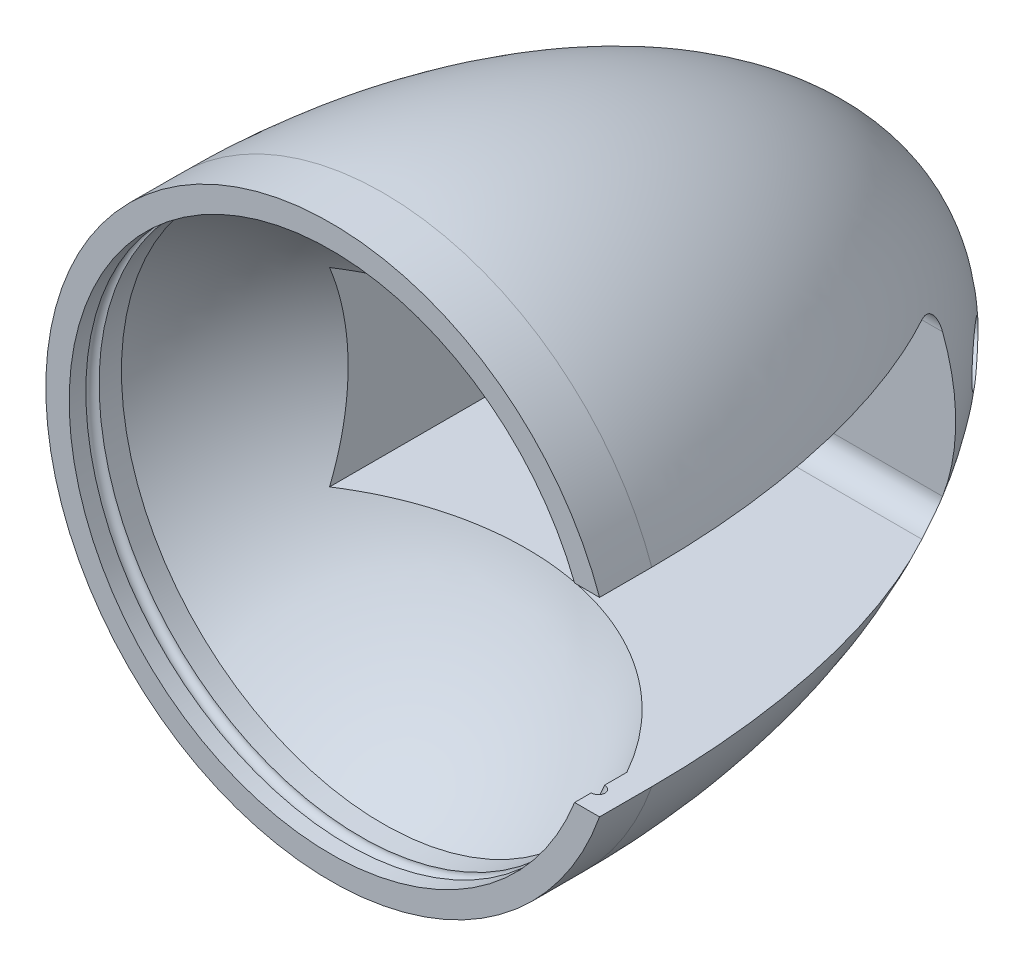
ISO-10303-21;
HEADER;
FILE_DESCRIPTION(('STEP AP214'),'2;1');
FILE_NAME('part.step','',(''),(''),'','','');
FILE_SCHEMA(('AUTOMOTIVE_DESIGN { 1 0 10303 214 1 1 1 1 }'));
ENDSEC;
DATA;
#1=APPLICATION_CONTEXT('core data for automotive mechanical design processes');
#2=APPLICATION_PROTOCOL_DEFINITION('international standard','automotive_design',2000,#1);
#3=PRODUCT_CONTEXT('',#1,'mechanical');
#4=PRODUCT('Part','Part','',(#3));
#5=PRODUCT_RELATED_PRODUCT_CATEGORY('part','',(#4));
#6=PRODUCT_DEFINITION_FORMATION('','',#4);
#7=PRODUCT_DEFINITION_CONTEXT('part definition',#1,'design');
#8=PRODUCT_DEFINITION('design','',#6,#7);
#9=PRODUCT_DEFINITION_SHAPE('','',#8);
#10=(LENGTH_UNIT() NAMED_UNIT(*) SI_UNIT(.MILLI.,.METRE.));
#11=(NAMED_UNIT(*) PLANE_ANGLE_UNIT() SI_UNIT($,.RADIAN.));
#12=(NAMED_UNIT(*) SI_UNIT($,.STERADIAN.) SOLID_ANGLE_UNIT());
#13=UNCERTAINTY_MEASURE_WITH_UNIT(LENGTH_MEASURE(1.E-05),#10,'distance_accuracy_value','');
#14=(GEOMETRIC_REPRESENTATION_CONTEXT(3) GLOBAL_UNCERTAINTY_ASSIGNED_CONTEXT((#13)) GLOBAL_UNIT_ASSIGNED_CONTEXT((#10,
#11,#12)) REPRESENTATION_CONTEXT('',''));
#15=CARTESIAN_POINT('',(0.,0.,0.));
#16=DIRECTION('',(0.,0.,1.));
#17=DIRECTION('',(1.,0.,0.));
#18=AXIS2_PLACEMENT_3D('',#15,#16,#17);
#19=CARTESIAN_POINT('',(0.,0.,27.9835117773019));
#20=DIRECTION('',(0.,0.,1.));
#21=DIRECTION('',(1.,0.,0.));
#22=AXIS2_PLACEMENT_3D('',#19,#20,#21);
#23=CYLINDRICAL_SURFACE('',#22,38.1);
#24=DIRECTION('',(0.,0.,1.));
#25=VECTOR('',#24,1.);
#26=CARTESIAN_POINT('',(35.9210244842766,12.7,27.9835117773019));
#27=LINE('',#26,#25);
#28=CARTESIAN_POINT('',(35.9210244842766,12.7,-6.98500000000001));
#29=VERTEX_POINT('',#28);
#30=CARTESIAN_POINT('',(35.9210244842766,12.7,0.));
#31=VERTEX_POINT('',#30);
#32=EDGE_CURVE('E208',#29,#31,#27,.T.);
#33=ORIENTED_EDGE('',*,*,#32,.F.);
#34=CARTESIAN_POINT('',(0.,0.,-6.985));
#35=DIRECTION('',(0.,0.,1.));
#36=DIRECTION('',(1.,0.,0.));
#37=AXIS2_PLACEMENT_3D('',#34,#35,#36);
#38=CIRCLE('',#37,38.1);
#39=CARTESIAN_POINT('',(35.9210244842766,-12.7,-6.98500000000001));
#40=VERTEX_POINT('',#39);
#41=EDGE_CURVE('E226',#29,#40,#38,.T.);
#42=ORIENTED_EDGE('',*,*,#41,.T.);
#43=DIRECTION('',(0.,0.,1.));
#44=VECTOR('',#43,1.);
#45=CARTESIAN_POINT('',(35.9210244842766,-12.7,27.9835117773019));
#46=LINE('',#45,#44);
#47=CARTESIAN_POINT('',(35.9210244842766,-12.7,0.));
#48=VERTEX_POINT('',#47);
#49=EDGE_CURVE('E192',#48,#40,#46,.F.);
#50=ORIENTED_EDGE('',*,*,#49,.F.);
#51=CARTESIAN_POINT('',(0.,0.,0.));
#52=DIRECTION('',(0.,0.,1.));
#53=DIRECTION('',(1.,0.,0.));
#54=AXIS2_PLACEMENT_3D('',#51,#52,#53);
#55=CIRCLE('',#54,38.1);
#56=EDGE_CURVE('E223',#31,#48,#55,.T.);
#57=ORIENTED_EDGE('',*,*,#56,.F.);
#58=EDGE_LOOP('',(#33,#42,#50,#57));
#59=FACE_BOUND('',#58,.T.);
#60=ADVANCED_FACE('F36',(#59),#23,.T.);
#61=CARTESIAN_POINT('',(0.,0.,0.));
#62=DIRECTION('',(0.,0.,-1.));
#63=DIRECTION('',(-1.,0.,0.));
#64=AXIS2_PLACEMENT_3D('',#61,#62,#63);
#65=PLANE('',#64);
#66=CARTESIAN_POINT('',(0.,0.,0.));
#67=DIRECTION('',(0.,0.,1.));
#68=DIRECTION('',(1.,0.,0.));
#69=AXIS2_PLACEMENT_3D('',#66,#67,#68);
#70=CIRCLE('',#69,34.9758);
#71=CARTESIAN_POINT('',(32.5885959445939,12.7,0.));
#72=VERTEX_POINT('',#71);
#73=CARTESIAN_POINT('',(32.5885959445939,-12.7,0.));
#74=VERTEX_POINT('',#73);
#75=EDGE_CURVE('E220',#72,#74,#70,.T.);
#76=ORIENTED_EDGE('',*,*,#75,.F.);
#77=DIRECTION('',(1.,0.,0.));
#78=VECTOR('',#77,1.);
#79=CARTESIAN_POINT('',(-20.32,12.7,0.));
#80=LINE('',#79,#78);
#81=EDGE_CURVE('E150',#72,#31,#80,.T.);
#82=ORIENTED_EDGE('',*,*,#81,.T.);
#83=ORIENTED_EDGE('',*,*,#56,.T.);
#84=DIRECTION('',(1.,0.,0.));
#85=VECTOR('',#84,1.);
#86=CARTESIAN_POINT('',(-20.32,-12.7,0.));
#87=LINE('',#86,#85);
#88=EDGE_CURVE('E138',#74,#48,#87,.T.);
#89=ORIENTED_EDGE('',*,*,#88,.F.);
#90=EDGE_LOOP('',(#76,#82,#83,#89));
#91=FACE_BOUND('',#90,.T.);
#92=ADVANCED_FACE('F248',(#91),#65,.F.);
#93=CARTESIAN_POINT('',(0.,0.,27.9835117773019));
#94=DIRECTION('',(0.,0.,1.));
#95=DIRECTION('',(1.,0.,0.));
#96=AXIS2_PLACEMENT_3D('',#93,#94,#95);
#97=CYLINDRICAL_SURFACE('',#96,34.9758);
#98=CARTESIAN_POINT('',(0.,0.,-2.2225));
#99=DIRECTION('',(0.,0.,1.));
#100=DIRECTION('',(1.,0.,0.));
#101=AXIS2_PLACEMENT_3D('',#98,#99,#100);
#102=CIRCLE('',#101,34.9758);
#103=CARTESIAN_POINT('',(32.5885959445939,12.7,-2.22249999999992));
#104=VERTEX_POINT('',#103);
#105=CARTESIAN_POINT('',(32.5885959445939,-12.7,-2.2225));
#106=VERTEX_POINT('',#105);
#107=EDGE_CURVE('E217',#104,#106,#102,.T.);
#108=ORIENTED_EDGE('',*,*,#107,.F.);
#109=DIRECTION('',(0.,0.,1.));
#110=VECTOR('',#109,1.);
#111=CARTESIAN_POINT('',(32.5885959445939,12.7,27.9835117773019));
#112=LINE('',#111,#110);
#113=EDGE_CURVE('E310',#104,#72,#112,.T.);
#114=ORIENTED_EDGE('',*,*,#113,.T.);
#115=ORIENTED_EDGE('',*,*,#75,.T.);
#116=DIRECTION('',(0.,0.,1.));
#117=VECTOR('',#116,1.);
#118=CARTESIAN_POINT('',(32.5885959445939,-12.7,27.9835117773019));
#119=LINE('',#118,#117);
#120=EDGE_CURVE('E171',#74,#106,#119,.F.);
#121=ORIENTED_EDGE('',*,*,#120,.T.);
#122=EDGE_LOOP('',(#108,#114,#115,#121));
#123=FACE_BOUND('',#122,.T.);
#124=ADVANCED_FACE('F253',(#123),#97,.F.);
#125=CARTESIAN_POINT('',(0.,0.,-3.1115));
#126=DIRECTION('',(0.,0.,1.));
#127=DIRECTION('',(1.,0.,0.));
#128=AXIS2_PLACEMENT_3D('',#125,#126,#127);
#129=TOROIDAL_SURFACE('',#128,34.9758,0.889000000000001);
#130=CARTESIAN_POINT('',(31.811688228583,12.7,-3.62918445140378));
#131=CARTESIAN_POINT('',(31.7823798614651,12.7,-3.59118233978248));
#132=CARTESIAN_POINT('',(31.7561237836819,12.7,-3.5508000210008));
#133=CARTESIAN_POINT('',(31.7106512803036,12.7,-3.46621901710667));
#134=CARTESIAN_POINT('',(31.691437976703,12.7,-3.42201865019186));
#135=CARTESIAN_POINT('',(31.6607841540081,12.7,-3.33090519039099));
#136=CARTESIAN_POINT('',(31.6493566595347,12.7,-3.28398769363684));
#137=CARTESIAN_POINT('',(31.6348119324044,12.7,-3.18888597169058));
#138=CARTESIAN_POINT('',(31.6316928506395,12.7,-3.14070203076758));
#139=CARTESIAN_POINT('',(31.6338620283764,12.7,-3.04591216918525));
#140=CARTESIAN_POINT('',(31.6389118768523,12.7,-2.99930060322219));
#141=CARTESIAN_POINT('',(31.6567645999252,12.7,-2.90759241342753));
#142=CARTESIAN_POINT('',(31.6695673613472,12.7,-2.86249576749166));
#143=CARTESIAN_POINT('',(31.7024420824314,12.7,-2.77499156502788));
#144=CARTESIAN_POINT('',(31.7225216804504,12.7,-2.73258688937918));
#145=CARTESIAN_POINT('',(31.7692210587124,12.7,-2.6515545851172));
#146=CARTESIAN_POINT('',(31.7958418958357,12.7,-2.61292756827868));
#147=CARTESIAN_POINT('',(31.8560797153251,12.7,-2.53865686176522));
#148=CARTESIAN_POINT('',(31.889956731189,12.7,-2.50322440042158));
#149=CARTESIAN_POINT('',(31.962839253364,12.7,-2.43810738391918));
#150=CARTESIAN_POINT('',(32.0018462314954,12.7,-2.40842448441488));
#151=CARTESIAN_POINT('',(32.0867083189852,12.7,-2.35350837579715));
#152=CARTESIAN_POINT('',(32.1328490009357,12.7,-2.32871648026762));
#153=CARTESIAN_POINT('',(32.2284529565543,12.7,-2.28669547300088));
#154=CARTESIAN_POINT('',(32.2779172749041,12.7,-2.26946875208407));
#155=CARTESIAN_POINT('',(32.3821406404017,12.7,-2.24199094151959));
#156=CARTESIAN_POINT('',(32.4370360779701,12.7,-2.23225566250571));
#157=CARTESIAN_POINT('',(32.5476841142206,12.7,-2.22180806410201));
#158=CARTESIAN_POINT('',(32.6034369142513,12.7,-2.22109789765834));
#159=CARTESIAN_POINT('',(32.7161752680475,12.7,-2.22886159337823));
#160=CARTESIAN_POINT('',(32.7731401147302,12.7,-2.23764182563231));
#161=CARTESIAN_POINT('',(32.8847610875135,12.7,-2.26475473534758));
#162=CARTESIAN_POINT('',(32.9394171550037,12.7,-2.28308765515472));
#163=CARTESIAN_POINT('',(33.0440657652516,12.7,-2.32870692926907));
#164=CARTESIAN_POINT('',(33.0941076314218,12.7,-2.3558797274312));
#165=CARTESIAN_POINT('',(33.1885784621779,12.7,-2.41868655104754));
#166=CARTESIAN_POINT('',(33.2330090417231,12.7,-2.45431813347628));
#167=CARTESIAN_POINT('',(33.3123961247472,12.7,-2.53106971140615));
#168=CARTESIAN_POINT('',(33.3477297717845,12.7,-2.57179907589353));
#169=CARTESIAN_POINT('',(33.4104530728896,12.7,-2.65897777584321));
#170=CARTESIAN_POINT('',(33.4378464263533,12.7,-2.70542443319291));
#171=CARTESIAN_POINT('',(33.4819426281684,12.7,-2.7992885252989));
#172=CARTESIAN_POINT('',(33.4992474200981,12.7,-2.84642344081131));
#173=CARTESIAN_POINT('',(33.5252159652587,12.7,-2.94301451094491));
#174=CARTESIAN_POINT('',(33.5338828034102,12.7,-2.99246983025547));
#175=CARTESIAN_POINT('',(33.5419925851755,12.7,-3.08958066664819));
#176=CARTESIAN_POINT('',(33.5418835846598,12.7,-3.13719927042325));
#177=CARTESIAN_POINT('',(33.5335599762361,12.7,-3.23171782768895));
#178=CARTESIAN_POINT('',(33.5253463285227,12.7,-3.27861786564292));
#179=CARTESIAN_POINT('',(33.5012887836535,12.7,-3.36978633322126));
#180=CARTESIAN_POINT('',(33.4855406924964,12.7,-3.41408016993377));
#181=CARTESIAN_POINT('',(33.4470324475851,12.7,-3.49949994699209));
#182=CARTESIAN_POINT('',(33.4242716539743,12.7,-3.54062559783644));
#183=CARTESIAN_POINT('',(33.3717660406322,12.7,-3.6198459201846));
#184=CARTESIAN_POINT('',(33.3418402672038,12.7,-3.65782042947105));
#185=CARTESIAN_POINT('',(33.2763538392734,12.7,-3.72854402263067));
#186=CARTESIAN_POINT('',(33.2407918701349,12.7,-3.76129188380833));
#187=CARTESIAN_POINT('',(33.1629038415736,12.7,-3.8226375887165));
#188=CARTESIAN_POINT('',(33.1203077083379,12.7,-3.85089230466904));
#189=CARTESIAN_POINT('',(33.0312071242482,12.7,-3.90035442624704));
#190=CARTESIAN_POINT('',(32.9847015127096,12.7,-3.92155972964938));
#191=CARTESIAN_POINT('',(32.8858971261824,12.7,-3.95772957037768));
#192=CARTESIAN_POINT('',(32.8334181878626,12.7,-3.97220247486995));
#193=CARTESIAN_POINT('',(32.7268224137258,12.7,-3.99257965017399));
#194=CARTESIAN_POINT('',(32.6727051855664,12.7,-3.99848185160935));
#195=CARTESIAN_POINT('',(32.5616302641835,12.7,-4.00172228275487));
#196=CARTESIAN_POINT('',(32.5046598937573,12.7,-3.99863984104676));
#197=CARTESIAN_POINT('',(32.3919981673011,12.7,-3.98305285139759));
#198=CARTESIAN_POINT('',(32.3363073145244,12.7,-3.97054465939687));
#199=CARTESIAN_POINT('',(32.2273035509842,12.7,-3.93615652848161));
#200=CARTESIAN_POINT('',(32.1740184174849,12.7,-3.91418825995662));
#201=CARTESIAN_POINT('',(32.0721412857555,12.7,-3.86128903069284));
#202=CARTESIAN_POINT('',(32.0235431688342,12.7,-3.83036997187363));
#203=CARTESIAN_POINT('',(31.9470362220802,12.7,-3.77130915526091));
#204=CARTESIAN_POINT('',(31.9174239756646,12.7,-3.74534625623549));
#205=CARTESIAN_POINT('',(31.8617548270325,12.7,-3.68984911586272));
#206=CARTESIAN_POINT('',(31.8356973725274,12.7,-3.66031543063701));
#207=CARTESIAN_POINT('',(31.811688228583,12.7,-3.62918445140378));
#208=B_SPLINE_CURVE_WITH_KNOTS('',3,(#130,#131,#132,#133,#134,#135,#136,#137,#138,#139,#140,
#141,#142,#143,#144,#145,#146,#147,#148,#149,#150,#151,#152,#153,#154,#155,#156,#157,#158,#159,
#160,#161,#162,#163,#164,#165,#166,#167,#168,#169,#170,#171,#172,#173,#174,#175,#176,#177,#178,
#179,#180,#181,#182,#183,#184,#185,#186,#187,#188,#189,#190,#191,#192,#193,#194,#195,#196,#197,
#198,#199,#200,#201,#202,#203,#204,#205,#206,#207),.UNSPECIFIED.,.T.,.F.,(4,2,2,2,2,2,2,2,2,2,2,
2,2,2,2,2,2,2,2,2,2,2,2,2,2,2,2,2,2,2,2,2,2,2,2,2,2,2,4),(0.,0.143841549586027,
0.287746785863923,0.431892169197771,0.576005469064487,0.71598815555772,0.855968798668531,
0.996096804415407,1.13624746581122,1.28267794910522,1.42915053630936,1.58560880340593,
1.74211648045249,1.90862035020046,2.07516393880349,2.24724899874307,2.41933842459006,
2.58929916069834,2.75921086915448,2.9201235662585,3.08096117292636,3.23082354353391,
3.38063237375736,3.52279772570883,3.66494623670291,3.80533341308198,3.94573340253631,
4.09014458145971,4.23458949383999,4.38727104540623,4.53999808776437,4.70259106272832,
4.86522328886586,5.03559063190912,5.20602387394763,5.37808419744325,5.54991677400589,
5.66776877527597,5.78560244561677),.UNSPECIFIED.);
#209=CARTESIAN_POINT('',(32.5885959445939,12.7,-4.0005));
#210=VERTEX_POINT('',#209);
#211=EDGE_CURVE('E303',#104,#210,#208,.T.);
#212=ORIENTED_EDGE('',*,*,#211,.F.);
#213=ORIENTED_EDGE('',*,*,#107,.T.);
#214=CARTESIAN_POINT('',(31.811688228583,-12.7,-3.62918445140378));
#215=CARTESIAN_POINT('',(31.8440242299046,-12.7,-3.67110533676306));
#216=CARTESIAN_POINT('',(31.8801273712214,-12.7,-3.71019179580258));
#217=CARTESIAN_POINT('',(31.9585030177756,-12.7,-3.78168962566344));
#218=CARTESIAN_POINT('',(32.0007886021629,-12.7,-3.81408648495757));
#219=CARTESIAN_POINT('',(32.0899541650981,-12.7,-3.87138588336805));
#220=CARTESIAN_POINT('',(32.1368181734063,-12.7,-3.89631332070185));
#221=CARTESIAN_POINT('',(32.2338852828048,-12.7,-3.9383777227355));
#222=CARTESIAN_POINT('',(32.2840872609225,-12.7,-3.95551729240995));
#223=CARTESIAN_POINT('',(32.3891835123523,-12.7,-3.98243488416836));
#224=CARTESIAN_POINT('',(32.4441863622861,-12.7,-3.99178971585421));
#225=CARTESIAN_POINT('',(32.5549919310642,-12.7,-4.00145975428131));
#226=CARTESIAN_POINT('',(32.6107949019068,-12.7,-4.00177204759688));
#227=CARTESIAN_POINT('',(32.7235342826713,-12.7,-3.99318830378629));
#228=CARTESIAN_POINT('',(32.7804481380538,-12.7,-3.98399100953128));
#229=CARTESIAN_POINT('',(32.8918932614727,-12.7,-3.95604847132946));
#230=CARTESIAN_POINT('',(32.9464244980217,-12.7,-3.93730310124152));
#231=CARTESIAN_POINT('',(33.050694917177,-12.7,-3.89090219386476));
#232=CARTESIAN_POINT('',(33.100488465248,-12.7,-3.86336925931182));
#233=CARTESIAN_POINT('',(33.1943975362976,-12.7,-3.79988616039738));
#234=CARTESIAN_POINT('',(33.2385147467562,-12.7,-3.76393850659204));
#235=CARTESIAN_POINT('',(33.3172071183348,-12.7,-3.68665375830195));
#236=CARTESIAN_POINT('',(33.352167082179,-12.7,-3.64570899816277));
#237=CARTESIAN_POINT('',(33.414110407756,-12.7,-3.55817076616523));
#238=CARTESIAN_POINT('',(33.4410974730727,-12.7,-3.51157993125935));
#239=CARTESIAN_POINT('',(33.4843937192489,-12.7,-3.41751233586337));
#240=CARTESIAN_POINT('',(33.5013056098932,-12.7,-3.37031270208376));
#241=CARTESIAN_POINT('',(33.5264896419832,-12.7,-3.27366417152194));
#242=CARTESIAN_POINT('',(33.5347648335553,-12.7,-3.22421607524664));
#243=CARTESIAN_POINT('',(33.5421321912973,-12.7,-3.12715388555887));
#244=CARTESIAN_POINT('',(33.5416657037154,-12.7,-3.07957279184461));
#245=CARTESIAN_POINT('',(33.5326467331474,-12.7,-2.98518816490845));
#246=CARTESIAN_POINT('',(33.5240951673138,-12.7,-2.93838454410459));
#247=CARTESIAN_POINT('',(33.4993860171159,-12.7,-2.84741649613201));
#248=CARTESIAN_POINT('',(33.4833167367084,-12.7,-2.80322796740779));
#249=CARTESIAN_POINT('',(33.4441931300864,-12.7,-2.71806664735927));
#250=CARTESIAN_POINT('',(33.4211381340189,-12.7,-2.67709416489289));
#251=CARTESIAN_POINT('',(33.3680497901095,-12.7,-2.5981942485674));
#252=CARTESIAN_POINT('',(33.3378314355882,-12.7,-2.56039153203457));
#253=CARTESIAN_POINT('',(33.2717929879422,-12.7,-2.49005332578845));
#254=CARTESIAN_POINT('',(33.2359715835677,-12.7,-2.45751907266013));
#255=CARTESIAN_POINT('',(33.1575729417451,-12.7,-2.39663629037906));
#256=CARTESIAN_POINT('',(33.1147258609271,-12.7,-2.3686354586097));
#257=CARTESIAN_POINT('',(33.0251661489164,-12.7,-2.31971804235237));
#258=CARTESIAN_POINT('',(32.9784523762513,-12.7,-2.29880355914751));
#259=CARTESIAN_POINT('',(32.8792717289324,-12.7,-2.26326824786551));
#260=CARTESIAN_POINT('',(32.8266281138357,-12.7,-2.24914016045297));
#261=CARTESIAN_POINT('',(32.7197575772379,-12.7,-2.22947933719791));
#262=CARTESIAN_POINT('',(32.6655302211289,-12.7,-2.22394898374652));
#263=CARTESIAN_POINT('',(32.5543202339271,-12.7,-2.22149380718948));
#264=CARTESIAN_POINT('',(32.4973279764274,-12.7,-2.22498598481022));
#265=CARTESIAN_POINT('',(32.3847076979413,-12.7,-2.24139842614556));
#266=CARTESIAN_POINT('',(32.3290798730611,-12.7,-2.25432003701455));
#267=CARTESIAN_POINT('',(32.2203536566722,-12.7,-2.28951345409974));
#268=CARTESIAN_POINT('',(32.1672793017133,-12.7,-2.31185987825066));
#269=CARTESIAN_POINT('',(32.0658428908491,-12.7,-2.36549344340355));
#270=CARTESIAN_POINT('',(32.0174801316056,-12.7,-2.39677924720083));
#271=CARTESIAN_POINT('',(31.9289704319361,-12.7,-2.46621949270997));
#272=CARTESIAN_POINT('',(31.8885767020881,-12.7,-2.50405861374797));
#273=CARTESIAN_POINT('',(31.8153096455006,-12.7,-2.58643475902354));
#274=CARTESIAN_POINT('',(31.7824327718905,-12.7,-2.63096860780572));
#275=CARTESIAN_POINT('',(31.7276455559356,-12.7,-2.72209753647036));
#276=CARTESIAN_POINT('',(31.7051254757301,-12.7,-2.76832595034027));
#277=CARTESIAN_POINT('',(31.66880053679,-12.7,-2.86408521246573));
#278=CARTESIAN_POINT('',(31.6549911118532,-12.7,-2.91361431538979));
#279=CARTESIAN_POINT('',(31.6373282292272,-12.7,-3.01101936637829));
#280=CARTESIAN_POINT('',(31.6328756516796,-12.7,-3.0587873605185));
#281=CARTESIAN_POINT('',(31.6323078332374,-12.7,-3.15438349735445));
#282=CARTESIAN_POINT('',(31.6361932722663,-12.7,-3.20221164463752));
#283=CARTESIAN_POINT('',(31.6519126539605,-12.7,-3.29517822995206));
#284=CARTESIAN_POINT('',(31.6635259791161,-12.7,-3.34035445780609));
#285=CARTESIAN_POINT('',(31.6940163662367,-12.7,-3.42813324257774));
#286=CARTESIAN_POINT('',(31.7128840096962,-12.7,-3.47073905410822));
#287=CARTESIAN_POINT('',(31.7461948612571,-12.7,-3.53212497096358));
#288=CARTESIAN_POINT('',(31.7582074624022,-12.7,-3.55226232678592));
#289=CARTESIAN_POINT('',(31.7837968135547,-12.7,-3.59151302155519));
#290=CARTESIAN_POINT('',(31.7973733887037,-12.7,-3.61062647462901));
#291=CARTESIAN_POINT('',(31.811688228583,-12.7,-3.62918445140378));
#292=B_SPLINE_CURVE_WITH_KNOTS('',3,(#214,#215,#216,#217,#218,#219,#220,#221,#222,#223,#224,
#225,#226,#227,#228,#229,#230,#231,#232,#233,#234,#235,#236,#237,#238,#239,#240,#241,#242,#243,
#244,#245,#246,#247,#248,#249,#250,#251,#252,#253,#254,#255,#256,#257,#258,#259,#260,#261,#262,
#263,#264,#265,#266,#267,#268,#269,#270,#271,#272,#273,#274,#275,#276,#277,#278,#279,#280,#281,
#282,#283,#284,#285,#286,#287,#288,#289,#290,#291),.UNSPECIFIED.,.T.,.F.,(4,2,2,2,2,2,2,2,2,2,2,
2,2,2,2,2,2,2,2,2,2,2,2,2,2,2,2,2,2,2,2,2,2,2,2,2,2,2,4),(0.,0.158737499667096,
0.317815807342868,0.476357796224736,0.634846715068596,0.801473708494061,0.968154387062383,
1.140282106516,1.31241210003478,1.48223846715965,1.65201423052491,1.81268663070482,
1.97328427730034,2.12292913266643,2.27252112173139,2.41458187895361,2.55662652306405,
2.69704304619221,2.83747303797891,2.98202595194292,3.12661274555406,3.27950327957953,
3.43243910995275,3.59523573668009,3.758077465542,3.92857854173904,4.09910398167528,
4.27100562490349,4.44288156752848,4.60805696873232,4.77315426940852,4.92661211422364,
5.07998944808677,5.22320275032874,5.36642773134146,5.50572990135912,5.64485181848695,
5.7151312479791,5.78540282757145),.UNSPECIFIED.);
#293=CARTESIAN_POINT('',(32.5885959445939,-12.7,-4.0005));
#294=VERTEX_POINT('',#293);
#295=EDGE_CURVE('E164',#294,#106,#292,.T.);
#296=ORIENTED_EDGE('',*,*,#295,.F.);
#297=CARTESIAN_POINT('',(0.,0.,-4.0005));
#298=DIRECTION('',(0.,0.,1.));
#299=DIRECTION('',(1.,0.,0.));
#300=AXIS2_PLACEMENT_3D('',#297,#298,#299);
#301=CIRCLE('',#300,34.9758);
#302=EDGE_CURVE('E213',#210,#294,#301,.T.);
#303=ORIENTED_EDGE('',*,*,#302,.F.);
#304=EDGE_LOOP('',(#212,#213,#296,#303));
#305=FACE_BOUND('',#304,.T.);
#306=ADVANCED_FACE('F173',(#305),#129,.F.);
#307=CARTESIAN_POINT('',(0.,0.,-6.985));
#308=DIRECTION('',(1.,0.,0.));
#309=DIRECTION('',(0.,0.,1.));
#310=AXIS2_PLACEMENT_3D('',#307,#308,#309);
#311=ELLIPSE('',#310,69.85,38.1);
#312=TRIMMED_CURVE('',#311,(PARAMETER_VALUE(3.14159265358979)),
(PARAMETER_VALUE(6.28318530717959)),.T.,.PARAMETER.);
#313=CARTESIAN_POINT('',(0.,0.,27.9835117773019));
#314=DIRECTION('',(0.,0.,1.));
#315=AXIS1_PLACEMENT('',#313,#314);
#316=SURFACE_OF_REVOLUTION('',#312,#315);
#317=ORIENTED_EDGE('',*,*,#41,.F.);
#318=CARTESIAN_POINT('',(35.9210244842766,12.7,-6.98500000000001));
#319=CARTESIAN_POINT('',(35.9210082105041,12.7,-7.97536971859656));
#320=CARTESIAN_POINT('',(35.9088380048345,12.7,-8.96574260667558));
#321=CARTESIAN_POINT('',(35.8600315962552,12.7,-10.9475830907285));
#322=CARTESIAN_POINT('',(35.8233535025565,12.7,-11.9390496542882));
#323=CARTESIAN_POINT('',(35.7253097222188,12.7,-13.9220344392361));
#324=CARTESIAN_POINT('',(35.6639125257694,12.7,-14.9135511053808));
#325=CARTESIAN_POINT('',(35.516130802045,12.7,-16.8955860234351));
#326=CARTESIAN_POINT('',(35.4297247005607,12.7,-17.8861026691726));
#327=CARTESIAN_POINT('',(35.2315712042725,12.7,-19.8650830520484));
#328=CARTESIAN_POINT('',(35.1198116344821,12.7,-20.8535455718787));
#329=CARTESIAN_POINT('',(34.8705252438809,12.7,-22.8273587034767));
#330=CARTESIAN_POINT('',(34.7329949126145,12.7,-23.8127088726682));
#331=CARTESIAN_POINT('',(34.4351822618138,12.7,-25.7562361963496));
#332=CARTESIAN_POINT('',(34.2755117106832,12.7,-26.7145070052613));
#333=CARTESIAN_POINT('',(33.9305310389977,12.7,-28.6261426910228));
#334=CARTESIAN_POINT('',(33.7452283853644,12.7,-29.5795089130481));
#335=CARTESIAN_POINT('',(33.348301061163,12.7,-31.4803387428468));
#336=CARTESIAN_POINT('',(33.1366874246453,12.7,-32.4278046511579));
#337=CARTESIAN_POINT('',(32.6863236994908,12.7,-34.3158093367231));
#338=CARTESIAN_POINT('',(32.4475863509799,12.7,-35.2563511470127));
#339=CARTESIAN_POINT('',(31.9420029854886,12.7,-37.1294370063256));
#340=CARTESIAN_POINT('',(31.6751687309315,12.7,-38.0619842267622));
#341=CARTESIAN_POINT('',(31.1122128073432,12.7,-39.9179956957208));
#342=CARTESIAN_POINT('',(30.8160980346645,12.7,-40.8414620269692));
#343=CARTESIAN_POINT('',(30.3312591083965,12.7,-42.270952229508));
#344=CARTESIAN_POINT('',(30.1531086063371,12.7,-42.780582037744));
#345=CARTESIAN_POINT('',(29.7870534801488,12.7,-43.7962919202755));
#346=CARTESIAN_POINT('',(29.599149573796,12.7,-44.3023722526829));
#347=CARTESIAN_POINT('',(29.2133237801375,12.7,-45.3106362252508));
#348=CARTESIAN_POINT('',(29.0154030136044,12.7,-45.8128202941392));
#349=CARTESIAN_POINT('',(28.6092476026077,12.7,-46.8129410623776));
#350=CARTESIAN_POINT('',(28.4010140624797,12.7,-47.3108782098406));
#351=CARTESIAN_POINT('',(27.9720361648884,12.7,-48.3064775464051));
#352=CARTESIAN_POINT('',(27.7511987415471,12.7,-48.8040996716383));
#353=CARTESIAN_POINT('',(27.2983151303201,12.7,-49.7942633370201));
#354=CARTESIAN_POINT('',(27.0662681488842,12.7,-50.2868045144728));
#355=CARTESIAN_POINT('',(26.5905432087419,12.7,-51.2663968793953));
#356=CARTESIAN_POINT('',(26.3468623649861,12.7,-51.7534466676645));
#357=CARTESIAN_POINT('',(25.8473854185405,12.7,-52.7216023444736));
#358=CARTESIAN_POINT('',(25.591583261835,12.7,-53.2027051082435));
#359=CARTESIAN_POINT('',(25.329574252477,12.7,-53.6804235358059));
#360=B_SPLINE_CURVE_WITH_KNOTS('',3,(#318,#319,#320,#321,#322,#323,#324,#325,#326,#327,#328,
#329,#330,#331,#332,#333,#334,#335,#336,#337,#338,#339,#340,#341,#342,#343,#344,#345,#346,#347,
#348,#349,#350,#351,#352,#353,#354,#355,#356,#357,#358,#359),.UNSPECIFIED.,.F.,.F.,(4,2,2,2,2,2,
2,2,2,2,2,2,2,2,2,2,2,2,2,2,4),(0.,2.971039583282,5.94717053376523,8.9271072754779,
11.9096223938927,14.8935727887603,17.8779299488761,20.7920377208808,23.7052983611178,
26.6173413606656,29.5280221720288,32.4374892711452,35.3462727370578,36.965799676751,
38.5852076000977,40.2044347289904,41.8234888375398,43.4566256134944,45.089878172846,
46.7235378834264,48.3580223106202),.UNSPECIFIED.);
#361=CARTESIAN_POINT('',(25.329574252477,12.7,-53.6804235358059));
#362=VERTEX_POINT('',#361);
#363=EDGE_CURVE('E260',#29,#362,#360,.T.);
#364=ORIENTED_EDGE('',*,*,#363,.T.);
#365=CARTESIAN_POINT('',(25.329574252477,12.7,-53.6804235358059));
#366=CARTESIAN_POINT('',(25.2845005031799,12.7000012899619,-53.7625994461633));
#367=CARTESIAN_POINT('',(25.2404620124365,12.6968091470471,-53.8453741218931));
#368=CARTESIAN_POINT('',(25.1548154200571,12.6837688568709,-54.0117411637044));
#369=CARTESIAN_POINT('',(25.1132094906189,12.6739148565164,-54.095334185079));
#370=CARTESIAN_POINT('',(25.0325392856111,12.6471716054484,-54.2634983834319));
#371=CARTESIAN_POINT('',(24.9934986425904,12.6302253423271,-54.3480719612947));
#372=CARTESIAN_POINT('',(24.9187857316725,12.5890550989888,-54.5169289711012));
#373=CARTESIAN_POINT('',(24.8831129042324,12.5648323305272,-54.6012124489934));
#374=CARTESIAN_POINT('',(24.8153814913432,12.5087495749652,-54.7693513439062));
#375=CARTESIAN_POINT('',(24.7833461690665,12.4768441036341,-54.8532010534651));
#376=CARTESIAN_POINT('',(24.7236287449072,12.4053909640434,-55.0191264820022));
#377=CARTESIAN_POINT('',(24.6959440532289,12.3658478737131,-55.1012032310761));
#378=CARTESIAN_POINT('',(24.6454350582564,12.2792709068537,-55.262500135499));
#379=CARTESIAN_POINT('',(24.6225949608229,12.2322622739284,-55.3417288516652));
#380=CARTESIAN_POINT('',(24.5820536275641,12.1308401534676,-55.4966809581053));
#381=CARTESIAN_POINT('',(24.5643513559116,12.0764281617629,-55.5724050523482));
#382=CARTESIAN_POINT('',(24.5363756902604,11.9682508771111,-55.7096452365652));
#383=CARTESIAN_POINT('',(24.5254282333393,11.9153577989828,-55.7717133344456));
#384=CARTESIAN_POINT('',(24.5077530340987,11.8046193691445,-55.8919018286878));
#385=CARTESIAN_POINT('',(24.5010248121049,11.7467745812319,-55.9500226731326));
#386=CARTESIAN_POINT('',(24.4918442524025,11.6265509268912,-56.0617766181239));
#387=CARTESIAN_POINT('',(24.4893930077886,11.5641709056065,-56.1154085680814));
#388=CARTESIAN_POINT('',(24.4887423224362,11.4354437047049,-56.2176658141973));
#389=CARTESIAN_POINT('',(24.4905426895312,11.3690967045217,-56.2662913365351));
#390=CARTESIAN_POINT('',(24.5014857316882,11.1774351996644,-56.3956113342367));
#391=CARTESIAN_POINT('',(24.5154166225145,11.0481324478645,-56.4701428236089));
#392=CARTESIAN_POINT('',(24.5559185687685,10.7820661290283,-56.5997318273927));
#393=CARTESIAN_POINT('',(24.5824931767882,10.6453004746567,-56.6547838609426));
#394=CARTESIAN_POINT('',(24.6478936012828,10.3627806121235,-56.7466300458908));
#395=CARTESIAN_POINT('',(24.6871360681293,10.2168810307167,-56.7826738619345));
#396=CARTESIAN_POINT('',(24.7755758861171,9.92464617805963,-56.8336562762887));
#397=CARTESIAN_POINT('',(24.824760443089,9.77831170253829,-56.8486218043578));
#398=CARTESIAN_POINT('',(24.8912411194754,9.5970970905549,-56.8548127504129));
#399=CARTESIAN_POINT('',(24.9047654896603,9.560995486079,-56.8554258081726));
#400=CARTESIAN_POINT('',(24.9185251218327,9.525,-56.8554235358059));
#401=B_SPLINE_CURVE_WITH_KNOTS('',3,(#365,#366,#367,#368,#369,#370,#371,#372,#373,#374,#375,
#376,#377,#378,#379,#380,#381,#382,#383,#384,#385,#386,#387,#388,#389,#390,#391,#392,#393,#394,
#395,#396,#397,#398,#399,#400),.UNSPECIFIED.,.F.,.F.,(4,2,2,2,2,2,2,2,2,2,2,2,2,2,2,2,2,4),(0.,
0.281155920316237,0.562559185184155,0.846269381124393,1.12993235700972,1.41531789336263,
1.7005328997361,1.98480326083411,2.26901627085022,2.51551678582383,2.76198927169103,
3.00852474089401,3.25504906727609,3.70249539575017,4.15006752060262,4.61418833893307,
5.07771565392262,5.19335679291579),.UNSPECIFIED.);
#402=CARTESIAN_POINT('',(24.9185251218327,9.525,-56.8554235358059));
#403=VERTEX_POINT('',#402);
#404=EDGE_CURVE('E268',#362,#403,#401,.T.);
#405=ORIENTED_EDGE('',*,*,#404,.T.);
#406=CARTESIAN_POINT('',(0.,0.,-56.8554235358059));
#407=DIRECTION('',(0.,0.,1.));
#408=DIRECTION('',(1.,0.,0.));
#409=AXIS2_PLACEMENT_3D('',#406,#407,#408);
#410=CIRCLE('',#409,26.6769285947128);
#411=CARTESIAN_POINT('',(24.9185251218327,-9.525,-56.8554235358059));
#412=VERTEX_POINT('',#411);
#413=EDGE_CURVE('E265',#403,#412,#410,.F.);
#414=ORIENTED_EDGE('',*,*,#413,.T.);
#415=CARTESIAN_POINT('',(24.9185251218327,-9.525,-56.8554235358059));
#416=CARTESIAN_POINT('',(24.8885989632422,-9.60328839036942,-56.8554293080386));
#417=CARTESIAN_POINT('',(24.8598029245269,-9.68202889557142,-56.8525278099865));
#418=CARTESIAN_POINT('',(24.8047428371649,-9.83999873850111,-56.8407508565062));
#419=CARTESIAN_POINT('',(24.7784803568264,-9.9192283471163,-56.8318717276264));
#420=CARTESIAN_POINT('',(24.7286857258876,-10.0780173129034,-56.8079263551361));
#421=CARTESIAN_POINT('',(24.7051662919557,-10.1575765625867,-56.7928326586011));
#422=CARTESIAN_POINT('',(24.6613032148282,-10.3161227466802,-56.7563567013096));
#423=CARTESIAN_POINT('',(24.6409591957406,-10.3951097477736,-56.7349751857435));
#424=CARTESIAN_POINT('',(24.6036683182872,-10.5522738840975,-56.685775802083));
#425=CARTESIAN_POINT('',(24.5867365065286,-10.6304460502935,-56.6579305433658));
#426=CARTESIAN_POINT('',(24.5566850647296,-10.7849511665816,-56.5959120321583));
#427=CARTESIAN_POINT('',(24.5435634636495,-10.8612850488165,-56.5617420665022));
#428=CARTESIAN_POINT('',(24.5214102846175,-11.0113325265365,-56.4872795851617));
#429=CARTESIAN_POINT('',(24.5123705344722,-11.0850510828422,-56.4469995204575));
#430=CARTESIAN_POINT('',(24.4985625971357,-11.2293455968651,-56.3605175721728));
#431=CARTESIAN_POINT('',(24.493793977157,-11.2999218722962,-56.3143162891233));
#432=CARTESIAN_POINT('',(24.4888841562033,-11.4318365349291,-56.2202334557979));
#433=CARTESIAN_POINT('',(24.4884067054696,-11.4934640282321,-56.1727740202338));
#434=CARTESIAN_POINT('',(24.4912666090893,-11.6130380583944,-56.0734891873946));
#435=CARTESIAN_POINT('',(24.4946052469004,-11.6709833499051,-56.0216623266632));
#436=CARTESIAN_POINT('',(24.505103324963,-11.7827398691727,-55.9140860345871));
#437=CARTESIAN_POINT('',(24.5122626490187,-11.8365512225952,-55.8583367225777));
#438=CARTESIAN_POINT('',(24.530336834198,-11.9396934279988,-55.7433960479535));
#439=CARTESIAN_POINT('',(24.5412531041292,-11.9890225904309,-55.6842034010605));
#440=CARTESIAN_POINT('',(24.5784444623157,-12.1260048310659,-55.507165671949));
#441=CARTESIAN_POINT('',(24.6096228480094,-12.2073052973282,-55.3853253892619));
#442=CARTESIAN_POINT('',(24.684080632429,-12.3511109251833,-55.1346118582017));
#443=CARTESIAN_POINT('',(24.7273621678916,-12.4136127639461,-55.0057373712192));
#444=CARTESIAN_POINT('',(24.8279786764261,-12.523814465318,-54.7343562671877));
#445=CARTESIAN_POINT('',(24.8861293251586,-12.5700361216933,-54.5915560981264));
#446=CARTESIAN_POINT('',(25.0121971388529,-12.6414461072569,-54.3050763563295));
#447=CARTESIAN_POINT('',(25.0801142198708,-12.6666346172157,-54.1613967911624));
#448=CARTESIAN_POINT('',(25.1803348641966,-12.6880173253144,-53.9618820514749));
#449=CARTESIAN_POINT('',(25.2094760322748,-12.6925380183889,-53.9052130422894));
#450=CARTESIAN_POINT('',(25.2687747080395,-12.6985245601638,-53.7924209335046));
#451=CARTESIAN_POINT('',(25.2989295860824,-12.6999977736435,-53.7362968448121));
#452=CARTESIAN_POINT('',(25.3295742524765,-12.7000000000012,-53.6804235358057));
#453=B_SPLINE_CURVE_WITH_KNOTS('',3,(#415,#416,#417,#418,#419,#420,#421,#422,#423,#424,#425,
#426,#427,#428,#429,#430,#431,#432,#433,#434,#435,#436,#437,#438,#439,#440,#441,#442,#443,#444,
#445,#446,#447,#448,#449,#450,#451,#452),.UNSPECIFIED.,.F.,.F.,(4,2,2,2,2,2,2,2,2,2,2,2,2,2,2,2,
2,2,4),(0.,0.251408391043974,0.502971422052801,0.755657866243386,1.00831437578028,
1.26206173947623,1.51567760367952,1.76878343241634,2.02186361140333,2.25492140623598,
2.48805760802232,2.72118672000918,2.95440334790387,3.40154799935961,3.84877164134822,
4.32984145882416,4.81090714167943,5.00249315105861,5.19361561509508),.UNSPECIFIED.);
#454=CARTESIAN_POINT('',(25.329574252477,-12.7,-53.6804235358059));
#455=VERTEX_POINT('',#454);
#456=EDGE_CURVE('E264',#412,#455,#453,.T.);
#457=ORIENTED_EDGE('',*,*,#456,.T.);
#458=CARTESIAN_POINT('',(25.329574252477,-12.7,-53.6804235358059));
#459=CARTESIAN_POINT('',(25.5282466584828,-12.7,-53.3181959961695));
#460=CARTESIAN_POINT('',(25.7233437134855,-12.7,-52.9540236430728));
#461=CARTESIAN_POINT('',(26.1065735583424,-12.7,-52.2220465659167));
#462=CARTESIAN_POINT('',(26.294706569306,-12.7,-51.8542419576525));
#463=CARTESIAN_POINT('',(26.8483535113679,-12.7,-50.7469393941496));
#464=CARTESIAN_POINT('',(27.2037638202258,-12.7,-50.0023663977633));
#465=CARTESIAN_POINT('',(27.8886136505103,-12.7,-48.5021931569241));
#466=CARTESIAN_POINT('',(28.2180752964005,-12.7,-47.7466029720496));
#467=CARTESIAN_POINT('',(28.8524649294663,-12.7,-46.225523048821));
#468=CARTESIAN_POINT('',(29.1574016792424,-12.7,-45.4600369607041));
#469=CARTESIAN_POINT('',(29.7439315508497,-12.7,-43.9202235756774));
#470=CARTESIAN_POINT('',(30.0255255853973,-12.7,-43.1458966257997));
#471=CARTESIAN_POINT('',(30.5624448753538,-12.7,-41.6006932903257));
#472=CARTESIAN_POINT('',(30.8180901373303,-12.7,-40.829927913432));
#473=CARTESIAN_POINT('',(31.3085314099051,-12.7,-39.2815682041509));
#474=CARTESIAN_POINT('',(31.5433216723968,-12.7,-38.5039720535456));
#475=CARTESIAN_POINT('',(31.9927560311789,-12.7,-36.9427774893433));
#476=CARTESIAN_POINT('',(32.2073950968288,-12.7,-36.159177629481));
#477=CARTESIAN_POINT('',(32.617133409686,-12.7,-34.5867760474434));
#478=CARTESIAN_POINT('',(32.8122299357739,-12.7,-33.7979736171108));
#479=CARTESIAN_POINT('',(33.1834108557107,-12.7,-32.2159455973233));
#480=CARTESIAN_POINT('',(33.3594959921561,-12.7,-31.4227201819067));
#481=CARTESIAN_POINT('',(33.6881526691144,-12.7,-29.8562681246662));
#482=CARTESIAN_POINT('',(33.8412714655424,-12.7,-29.0831561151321));
#483=CARTESIAN_POINT('',(34.1304723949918,-12.7,-27.5338987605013));
#484=CARTESIAN_POINT('',(34.2665575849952,-12.7,-26.7577539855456));
#485=CARTESIAN_POINT('',(34.5220589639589,-12.7,-25.202798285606));
#486=CARTESIAN_POINT('',(34.641476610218,-12.7,-24.4239875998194));
#487=CARTESIAN_POINT('',(34.8639523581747,-12.7,-22.864057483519));
#488=CARTESIAN_POINT('',(34.9670109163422,-12.7,-22.0829381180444));
#489=CARTESIAN_POINT('',(35.1570262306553,-12.7,-20.5187406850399));
#490=CARTESIAN_POINT('',(35.2439828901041,-12.7,-19.7356626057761));
#491=CARTESIAN_POINT('',(35.4031351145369,-12.7,-18.1566860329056));
#492=CARTESIAN_POINT('',(35.4751015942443,-12.7,-17.3607644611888));
#493=CARTESIAN_POINT('',(35.6028630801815,-12.7,-15.767607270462));
#494=CARTESIAN_POINT('',(35.658657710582,-12.7,-14.9703716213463));
#495=CARTESIAN_POINT('',(35.7542085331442,-12.7,-13.3749416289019));
#496=CARTESIAN_POINT('',(35.7939647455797,-12.7,-12.5767472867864));
#497=CARTESIAN_POINT('',(35.8575359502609,-12.7,-10.9797539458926));
#498=CARTESIAN_POINT('',(35.8813515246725,-12.7,-10.1809549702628));
#499=CARTESIAN_POINT('',(35.9130917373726,-12.7,-8.58310362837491));
#500=CARTESIAN_POINT('',(35.9210176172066,-12.7,-7.78405128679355));
#501=CARTESIAN_POINT('',(35.9210244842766,-12.7,-6.98500000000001));
#502=B_SPLINE_CURVE_WITH_KNOTS('',3,(#458,#459,#460,#461,#462,#463,#464,#465,#466,#467,#468,
#469,#470,#471,#472,#473,#474,#475,#476,#477,#478,#479,#480,#481,#482,#483,#484,#485,#486,#487,
#488,#489,#490,#491,#492,#493,#494,#495,#496,#497,#498,#499,#500,#501),.UNSPECIFIED.,.F.,.F.,(4,
2,2,2,2,2,2,2,2,2,2,2,2,2,2,2,2,2,2,2,2,4),(0.,1.23935613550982,2.47867288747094,
4.95325303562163,7.42569992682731,9.89725946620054,12.3687223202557,14.8045787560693,
17.2411044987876,19.6782368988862,22.1157081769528,24.5530842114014,26.9172778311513,
29.2810465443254,31.6446084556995,34.0081044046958,36.3716145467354,38.7689530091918,
41.1663471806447,43.5637383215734,45.9610419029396,48.3581581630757),.UNSPECIFIED.);
#503=EDGE_CURVE('E134',#455,#40,#502,.T.);
#504=ORIENTED_EDGE('',*,*,#503,.T.);
#505=EDGE_LOOP('',(#317,#364,#405,#414,#457,#504));
#506=FACE_BOUND('',#505,.T.);
#507=CARTESIAN_POINT('',(0.,0.,-76.835));
#508=VERTEX_POINT('',#507);
#509=VERTEX_LOOP('',#508);
#510=FACE_BOUND('',#509,.T.);
#511=CARTESIAN_POINT('',(22.9245120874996,0.,-62.7761));
#512=CARTESIAN_POINT('',(22.924512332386,-0.0757661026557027,-62.7760997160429));
#513=CARTESIAN_POINT('',(22.9222226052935,-0.151528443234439,-62.7787424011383));
#514=CARTESIAN_POINT('',(22.9131075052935,-0.30244260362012,-62.7892622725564));
#515=CARTESIAN_POINT('',(22.9062803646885,-0.377594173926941,-62.7971414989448));
#516=CARTESIAN_POINT('',(22.888217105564,-0.52662603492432,-62.8179873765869));
#517=CARTESIAN_POINT('',(22.8769824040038,-0.6005067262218,-62.8309523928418));
#518=CARTESIAN_POINT('',(22.8503073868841,-0.746487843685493,-62.8617337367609));
#519=CARTESIAN_POINT('',(22.8348652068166,-0.818587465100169,-62.8795522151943));
#520=CARTESIAN_POINT('',(22.7827856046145,-1.03066209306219,-62.9396410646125));
#521=CARTESIAN_POINT('',(22.7402748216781,-1.16736844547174,-62.9886837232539));
#522=CARTESIAN_POINT('',(22.6419720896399,-1.4289790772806,-63.102063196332));
#523=CARTESIAN_POINT('',(22.5861736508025,-1.55387754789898,-63.1664074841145));
#524=CARTESIAN_POINT('',(22.4426930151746,-1.83110701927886,-63.3318135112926));
#525=CARTESIAN_POINT('',(22.3506358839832,-1.97818461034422,-63.4379032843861));
#526=CARTESIAN_POINT('',(22.1520395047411,-2.24759345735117,-63.6666597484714));
#527=CARTESIAN_POINT('',(22.0454733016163,-2.36987757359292,-63.789357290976));
#528=CARTESIAN_POINT('',(21.7879132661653,-2.62347735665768,-64.0857378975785));
#529=CARTESIAN_POINT('',(21.6332681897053,-2.74621731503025,-64.2635740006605));
#530=CARTESIAN_POINT('',(21.3129708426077,-2.95194082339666,-64.6315921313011));
#531=CARTESIAN_POINT('',(21.1473108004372,-3.03489595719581,-64.821782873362));
#532=CARTESIAN_POINT('',(20.8066455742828,-3.16408280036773,-65.2125269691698));
#533=CARTESIAN_POINT('',(20.6315256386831,-3.20962410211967,-65.4132054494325));
#534=CARTESIAN_POINT('',(20.2785179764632,-3.26266714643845,-65.8173130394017));
#535=CARTESIAN_POINT('',(20.1006289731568,-3.27015078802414,-66.0207434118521));
#536=CARTESIAN_POINT('',(19.8187379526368,-3.25202511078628,-66.3427490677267));
#537=CARTESIAN_POINT('',(19.7144081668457,-3.23874935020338,-66.4618468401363));
#538=CARTESIAN_POINT('',(19.5067669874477,-3.19899476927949,-66.6987194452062));
#539=CARTESIAN_POINT('',(19.4034558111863,-3.17251319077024,-66.8164939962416));
#540=CARTESIAN_POINT('',(19.0962896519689,-3.07294501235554,-67.1664156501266));
#541=CARTESIAN_POINT('',(18.8948761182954,-2.97971562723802,-67.3955330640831));
#542=CARTESIAN_POINT('',(18.5591324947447,-2.76949509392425,-67.7769162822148));
#543=CARTESIAN_POINT('',(18.4212673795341,-2.66552665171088,-67.9333480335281));
#544=CARTESIAN_POINT('',(18.1579243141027,-2.42596749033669,-68.2318521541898));
#545=CARTESIAN_POINT('',(18.0324267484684,-2.29042803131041,-68.3739472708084));
#546=CARTESIAN_POINT('',(17.8261962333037,-2.02149173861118,-68.6072363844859));
#547=CARTESIAN_POINT('',(17.7417717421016,-1.89460857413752,-68.7026592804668));
#548=CARTESIAN_POINT('',(17.5874656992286,-1.62197800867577,-68.8769581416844));
#549=CARTESIAN_POINT('',(17.5175668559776,-1.47625337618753,-68.9558537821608));
#550=CARTESIAN_POINT('',(17.4067052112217,-1.19391324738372,-69.080924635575));
#551=CARTESIAN_POINT('',(17.3628493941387,-1.05991435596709,-69.1303753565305));
#552=CARTESIAN_POINT('',(17.3086071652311,-0.852170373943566,-69.1915208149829));
#553=CARTESIAN_POINT('',(17.2924471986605,-0.781778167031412,-69.2097340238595));
#554=CARTESIAN_POINT('',(17.2642259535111,-0.639163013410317,-69.2415373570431));
#555=CARTESIAN_POINT('',(17.2521629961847,-0.566940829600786,-69.2551293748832));
#556=CARTESIAN_POINT('',(17.2322983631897,-0.420790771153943,-69.2775103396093));
#557=CARTESIAN_POINT('',(17.2245188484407,-0.346856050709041,-69.286274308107));
#558=CARTESIAN_POINT('',(17.213465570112,-0.198253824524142,-69.2987259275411));
#559=CARTESIAN_POINT('',(17.2101899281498,-0.123586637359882,-69.3024156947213));
#560=CARTESIAN_POINT('',(17.2082035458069,0.0258930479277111,-69.3046532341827));
#561=CARTESIAN_POINT('',(17.2094932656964,0.100705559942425,-69.3032004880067));
#562=CARTESIAN_POINT('',(17.2166125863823,0.249834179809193,-69.295180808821));
#563=CARTESIAN_POINT('',(17.2224419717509,0.324150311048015,-69.2886141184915));
#564=CARTESIAN_POINT('',(17.2379097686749,0.466018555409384,-69.2711882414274));
#565=CARTESIAN_POINT('',(17.2472214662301,0.533652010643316,-69.2606972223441));
#566=CARTESIAN_POINT('',(17.2694676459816,0.667560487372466,-69.2356304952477));
#567=CARTESIAN_POINT('',(17.2824033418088,0.73383504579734,-69.2210534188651));
#568=CARTESIAN_POINT('',(17.3263658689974,0.929979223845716,-69.1715050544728));
#569=CARTESIAN_POINT('',(17.3625613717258,1.05728675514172,-69.1307017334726));
#570=CARTESIAN_POINT('',(17.4495260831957,1.31029009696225,-69.0326220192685));
#571=CARTESIAN_POINT('',(17.5010781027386,1.43536427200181,-68.974460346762));
#572=CARTESIAN_POINT('',(17.6152508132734,1.67335829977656,-68.8455759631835));
#573=CARTESIAN_POINT('',(17.677878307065,1.78627061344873,-68.7748455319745));
#574=CARTESIAN_POINT('',(17.8452054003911,2.05191347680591,-68.5857492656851));
#575=CARTESIAN_POINT('',(17.9554018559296,2.19674724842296,-68.4611161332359));
#576=CARTESIAN_POINT('',(18.1897305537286,2.45770227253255,-68.1958122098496));
#577=CARTESIAN_POINT('',(18.313894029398,2.57375723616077,-68.0551054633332));
#578=CARTESIAN_POINT('',(18.6099255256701,2.80829676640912,-67.719275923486));
#579=CARTESIAN_POINT('',(18.7850247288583,2.91730488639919,-67.5203860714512));
#580=CARTESIAN_POINT('',(19.1441413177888,3.09084533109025,-67.1119273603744));
#581=CARTESIAN_POINT('',(19.328162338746,3.15535936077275,-66.9023541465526));
#582=CARTESIAN_POINT('',(19.702896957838,3.24221300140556,-66.4750467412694));
#583=CARTESIAN_POINT('',(19.8936686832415,3.26393465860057,-66.2572386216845));
#584=CARTESIAN_POINT('',(20.2750644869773,3.26386518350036,-65.8212784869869));
#585=CARTESIAN_POINT('',(20.4656882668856,3.24203390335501,-65.6031263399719));
#586=CARTESIAN_POINT('',(20.8639211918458,3.14889325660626,-65.1468982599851));
#587=CARTESIAN_POINT('',(21.0710023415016,3.07224907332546,-64.9093714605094));
#588=CARTESIAN_POINT('',(21.3712264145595,2.91416360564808,-64.5646568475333));
#589=CARTESIAN_POINT('',(21.4695128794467,2.8543302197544,-64.4517448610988));
#590=CARTESIAN_POINT('',(21.6616582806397,2.71973237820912,-64.2309033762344));
#591=CARTESIAN_POINT('',(21.7555139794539,2.64495720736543,-64.1229775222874));
#592=CARTESIAN_POINT('',(21.9605335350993,2.45888912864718,-63.8871221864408));
#593=CARTESIAN_POINT('',(22.069977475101,2.34314813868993,-63.7611446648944));
#594=CARTESIAN_POINT('',(22.275639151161,2.08680453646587,-63.5243071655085));
#595=CARTESIAN_POINT('',(22.3718605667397,1.94620886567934,-63.4134429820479));
#596=CARTESIAN_POINT('',(22.5297483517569,1.66947134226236,-63.2314637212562));
#597=CARTESIAN_POINT('',(22.594509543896,1.53748109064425,-63.1567950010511));
#598=CARTESIAN_POINT('',(22.6802765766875,1.32889421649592,-63.0578851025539));
#599=CARTESIAN_POINT('',(22.7069553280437,1.25765104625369,-63.0271140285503));
#600=CARTESIAN_POINT('',(22.7561694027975,1.11192113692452,-62.9703453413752));
#601=CARTESIAN_POINT('',(22.778706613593,1.03743589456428,-62.9443455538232));
#602=CARTESIAN_POINT('',(22.8193373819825,0.885377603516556,-62.8974687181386));
#603=CARTESIAN_POINT('',(22.8374148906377,0.807794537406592,-62.8766101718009));
#604=CARTESIAN_POINT('',(22.8686762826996,0.650383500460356,-62.8405375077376));
#605=CARTESIAN_POINT('',(22.8818619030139,0.570556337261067,-62.8253213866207));
#606=CARTESIAN_POINT('',(22.9030705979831,0.409349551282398,-62.800845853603));
#607=CARTESIAN_POINT('',(22.9110959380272,0.327970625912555,-62.7915838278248));
#608=CARTESIAN_POINT('',(22.9218165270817,0.164392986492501,-62.7792110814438));
#609=CARTESIAN_POINT('',(22.9245118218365,0.0821942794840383,-62.7761003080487));
#610=CARTESIAN_POINT('',(22.9245120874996,0.,-62.7761));
#611=B_SPLINE_CURVE_WITH_KNOTS('',3,(#511,#512,#513,#514,#515,#516,#517,#518,#519,#520,#521,
#522,#523,#524,#525,#526,#527,#528,#529,#530,#531,#532,#533,#534,#535,#536,#537,#538,#539,#540,
#541,#542,#543,#544,#545,#546,#547,#548,#549,#550,#551,#552,#553,#554,#555,#556,#557,#558,#559,
#560,#561,#562,#563,#564,#565,#566,#567,#568,#569,#570,#571,#572,#573,#574,#575,#576,#577,#578,
#579,#580,#581,#582,#583,#584,#585,#586,#587,#588,#589,#590,#591,#592,#593,#594,#595,#596,#597,
#598,#599,#600,#601,#602,#603,#604,#605,#606,#607,#608,#609,#610),.UNSPECIFIED.,.T.,.F.,(4,2,2,
2,2,2,2,2,2,2,2,2,2,2,2,2,2,2,2,2,2,2,2,2,2,2,2,2,2,2,2,2,2,2,2,2,2,2,2,2,2,2,2,2,2,2,2,2,2,4),
(0.,0.227211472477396,0.454511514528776,0.681738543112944,0.909066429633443,1.3608415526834,
1.81283777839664,2.4196246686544,3.0275546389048,3.820484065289,4.61397899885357,
5.42180696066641,6.23001910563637,6.70616117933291,7.18240274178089,8.13341823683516,
8.83009792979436,9.5256542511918,10.0631339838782,10.5999701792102,11.0461612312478,
11.2693774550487,11.4925021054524,11.7167705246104,11.9409453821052,12.1651428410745,
12.3893296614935,12.5963085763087,12.8033568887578,13.2171003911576,13.6572548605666,
14.0976806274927,14.7557523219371,15.4153260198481,16.2704054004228,17.1258361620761,
17.9935319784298,18.8620280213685,19.8291040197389,20.3120687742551,20.7953811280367,
21.4024195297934,22.0092886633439,22.5018196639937,22.7477466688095,22.9935613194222,
23.240248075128,23.4868471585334,23.733337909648,23.9798265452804),.UNSPECIFIED.);
#612=CARTESIAN_POINT('',(22.9245120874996,0.,-62.7761));
#613=VERTEX_POINT('',#612);
#614=EDGE_CURVE('E214',#613,#613,#611,.T.);
#615=ORIENTED_EDGE('',*,*,#614,.F.);
#616=EDGE_LOOP('',(#615));
#617=FACE_BOUND('',#616,.T.);
#618=ADVANCED_FACE('F194',(#506,#510,#617),#316,.T.);
#619=CARTESIAN_POINT('',(0.,0.,27.9835117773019));
#620=DIRECTION('',(0.,0.,1.));
#621=DIRECTION('',(1.,0.,0.));
#622=AXIS2_PLACEMENT_3D('',#619,#620,#621);
#623=CYLINDRICAL_SURFACE('',#622,34.9758);
#624=CARTESIAN_POINT('',(0.,0.,-6.985));
#625=DIRECTION('',(0.,0.,1.));
#626=DIRECTION('',(1.,0.,0.));
#627=AXIS2_PLACEMENT_3D('',#624,#625,#626);
#628=CIRCLE('',#627,34.9758);
#629=CARTESIAN_POINT('',(32.5885959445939,12.7,-6.985));
#630=VERTEX_POINT('',#629);
#631=CARTESIAN_POINT('',(32.5885959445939,-12.7,-6.985));
#632=VERTEX_POINT('',#631);
#633=EDGE_CURVE('E210',#630,#632,#628,.T.);
#634=ORIENTED_EDGE('',*,*,#633,.F.);
#635=DIRECTION('',(0.,0.,1.));
#636=VECTOR('',#635,1.);
#637=CARTESIAN_POINT('',(32.5885959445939,12.7,27.9835117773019));
#638=LINE('',#637,#636);
#639=EDGE_CURVE('E298',#630,#210,#638,.T.);
#640=ORIENTED_EDGE('',*,*,#639,.T.);
#641=ORIENTED_EDGE('',*,*,#302,.T.);
#642=DIRECTION('',(0.,0.,1.));
#643=VECTOR('',#642,1.);
#644=CARTESIAN_POINT('',(32.5885959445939,-12.7,27.9835117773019));
#645=LINE('',#644,#643);
#646=EDGE_CURVE('E153',#294,#632,#645,.F.);
#647=ORIENTED_EDGE('',*,*,#646,.T.);
#648=EDGE_LOOP('',(#634,#640,#641,#647));
#649=FACE_BOUND('',#648,.T.);
#650=ADVANCED_FACE('F199',(#649),#623,.F.);
#651=CARTESIAN_POINT('',(0.,0.,11.0895764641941));
#652=DIRECTION('',(0.,0.,1.));
#653=DIRECTION('',(0.,1.,0.));
#654=AXIS2_PLACEMENT_3D('',#651,#652,#653);
#655=SPHERICAL_SURFACE('',#654,39.37);
#656=CARTESIAN_POINT('',(0.,12.7,11.0895764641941));
#657=DIRECTION('',(0.,1.,0.));
#658=DIRECTION('',(0.,0.,1.));
#659=AXIS2_PLACEMENT_3D('',#656,#657,#658);
#660=CIRCLE('',#659,37.2653579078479);
#661=CARTESIAN_POINT('',(-20.32,12.7,-20.1482931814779));
#662=VERTEX_POINT('',#661);
#663=EDGE_CURVE('E266',#630,#662,#660,.T.);
#664=ORIENTED_EDGE('',*,*,#663,.F.);
#665=ORIENTED_EDGE('',*,*,#633,.T.);
#666=CARTESIAN_POINT('',(0.,-12.7,11.0895764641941));
#667=DIRECTION('',(0.,-1.,0.));
#668=DIRECTION('',(0.,0.,-1.));
#669=AXIS2_PLACEMENT_3D('',#666,#667,#668);
#670=CIRCLE('',#669,37.2653579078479);
#671=CARTESIAN_POINT('',(-20.32,-12.7,-20.1482931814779));
#672=VERTEX_POINT('',#671);
#673=EDGE_CURVE('E270',#672,#632,#670,.T.);
#674=ORIENTED_EDGE('',*,*,#673,.F.);
#675=CARTESIAN_POINT('',(-20.32,0.,11.0895764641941));
#676=DIRECTION('',(-1.,0.,0.));
#677=DIRECTION('',(0.,0.,1.));
#678=AXIS2_PLACEMENT_3D('',#675,#676,#677);
#679=CIRCLE('',#678,33.7208318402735);
#680=EDGE_CURVE('E126',#662,#672,#679,.T.);
#681=ORIENTED_EDGE('',*,*,#680,.F.);
#682=EDGE_LOOP('',(#664,#665,#674,#681));
#683=FACE_BOUND('',#682,.T.);
#684=ADVANCED_FACE('F238',(#683),#655,.F.);
#685=CARTESIAN_POINT('',(38.1,0.,-66.04));
#686=DIRECTION('',(-1.,0.,0.));
#687=DIRECTION('',(0.,0.,1.));
#688=AXIS2_PLACEMENT_3D('',#685,#686,#687);
#689=CYLINDRICAL_SURFACE('',#688,3.26389999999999);
#690=CARTESIAN_POINT('',(0.,0.,-66.04));
#691=DIRECTION('',(1.,0.,0.));
#692=DIRECTION('',(0.,0.,-1.));
#693=AXIS2_PLACEMENT_3D('',#690,#691,#692);
#694=CIRCLE('',#693,3.26389999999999);
#695=CARTESIAN_POINT('',(0.,0.,-69.3039));
#696=VERTEX_POINT('',#695);
#697=EDGE_CURVE('E11',#696,#696,#694,.F.);
#698=ORIENTED_EDGE('',*,*,#697,.T.);
#699=EDGE_LOOP('',(#698));
#700=FACE_BOUND('',#699,.T.);
#701=ORIENTED_EDGE('',*,*,#614,.T.);
#702=EDGE_LOOP('',(#701));
#703=FACE_BOUND('',#702,.T.);
#704=ADVANCED_FACE('F234',(#700,#703),#689,.F.);
#705=CARTESIAN_POINT('',(-1.778,0.,0.));
#706=DIRECTION('',(1.,0.,0.));
#707=DIRECTION('',(0.,0.,-1.));
#708=AXIS2_PLACEMENT_3D('',#705,#706,#707);
#709=PLANE('',#708);
#710=CARTESIAN_POINT('',(-1.778,0.,-66.04));
#711=DIRECTION('',(1.,0.,0.));
#712=DIRECTION('',(0.,0.,-1.));
#713=AXIS2_PLACEMENT_3D('',#710,#711,#712);
#714=CIRCLE('',#713,0.304811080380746);
#715=CARTESIAN_POINT('',(-1.778,0.,-66.3448110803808));
#716=VERTEX_POINT('',#715);
#717=EDGE_CURVE('E44',#716,#716,#714,.T.);
#718=ORIENTED_EDGE('',*,*,#717,.T.);
#719=EDGE_LOOP('',(#718));
#720=FACE_BOUND('',#719,.T.);
#721=ADVANCED_FACE('F184',(#720),#709,.T.);
#722=CARTESIAN_POINT('',(-20.32,9.525,-53.6804235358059));
#723=DIRECTION('',(1.,0.,0.));
#724=DIRECTION('',(0.,0.,-1.));
#725=AXIS2_PLACEMENT_3D('',#722,#723,#724);
#726=CYLINDRICAL_SURFACE('',#725,3.175);
#727=DIRECTION('',(1.,0.,0.));
#728=VECTOR('',#727,1.);
#729=CARTESIAN_POINT('',(-20.32,12.7,-53.6804235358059));
#730=LINE('',#729,#728);
#731=CARTESIAN_POINT('',(-20.32,12.7,-53.6804235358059));
#732=VERTEX_POINT('',#731);
#733=EDGE_CURVE('E154',#732,#362,#730,.T.);
#734=ORIENTED_EDGE('',*,*,#733,.F.);
#735=CARTESIAN_POINT('',(-20.32,9.525,-53.6804235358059));
#736=DIRECTION('',(1.,0.,0.));
#737=DIRECTION('',(0.,0.,-1.));
#738=AXIS2_PLACEMENT_3D('',#735,#736,#737);
#739=CIRCLE('',#738,3.175);
#740=CARTESIAN_POINT('',(-20.32,9.525,-56.8554235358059));
#741=VERTEX_POINT('',#740);
#742=EDGE_CURVE('E145',#741,#732,#739,.T.);
#743=ORIENTED_EDGE('',*,*,#742,.F.);
#744=DIRECTION('',(1.,0.,0.));
#745=VECTOR('',#744,1.);
#746=CARTESIAN_POINT('',(-20.32,9.525,-56.8554235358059));
#747=LINE('',#746,#745);
#748=EDGE_CURVE('E157',#741,#403,#747,.T.);
#749=ORIENTED_EDGE('',*,*,#748,.T.);
#750=ORIENTED_EDGE('',*,*,#404,.F.);
#751=EDGE_LOOP('',(#734,#743,#749,#750));
#752=FACE_BOUND('',#751,.T.);
#753=ADVANCED_FACE('F282',(#752),#726,.F.);
#754=CARTESIAN_POINT('',(-20.32,9.525,-56.8554235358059));
#755=DIRECTION('',(0.,0.,-1.));
#756=DIRECTION('',(-1.,0.,0.));
#757=AXIS2_PLACEMENT_3D('',#754,#755,#756);
#758=PLANE('',#757);
#759=ORIENTED_EDGE('',*,*,#748,.F.);
#760=DIRECTION('',(0.,1.,0.));
#761=VECTOR('',#760,1.);
#762=CARTESIAN_POINT('',(-20.32,9.525,-56.8554235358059));
#763=LINE('',#762,#761);
#764=CARTESIAN_POINT('',(-20.32,-9.525,-56.8554235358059));
#765=VERTEX_POINT('',#764);
#766=EDGE_CURVE('E143',#765,#741,#763,.T.);
#767=ORIENTED_EDGE('',*,*,#766,.F.);
#768=DIRECTION('',(1.,0.,0.));
#769=VECTOR('',#768,1.);
#770=CARTESIAN_POINT('',(-20.32,-9.525,-56.8554235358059));
#771=LINE('',#770,#769);
#772=EDGE_CURVE('E137',#765,#412,#771,.T.);
#773=ORIENTED_EDGE('',*,*,#772,.T.);
#774=ORIENTED_EDGE('',*,*,#413,.F.);
#775=EDGE_LOOP('',(#759,#767,#773,#774));
#776=FACE_BOUND('',#775,.T.);
#777=ADVANCED_FACE('F286',(#776),#758,.F.);
#778=CARTESIAN_POINT('',(-20.32,-9.525,-53.6804235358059));
#779=DIRECTION('',(1.,0.,0.));
#780=DIRECTION('',(0.,0.,-1.));
#781=AXIS2_PLACEMENT_3D('',#778,#779,#780);
#782=CYLINDRICAL_SURFACE('',#781,3.175);
#783=ORIENTED_EDGE('',*,*,#772,.F.);
#784=CARTESIAN_POINT('',(-20.32,-9.525,-53.6804235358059));
#785=DIRECTION('',(1.,0.,0.));
#786=DIRECTION('',(0.,0.,1.));
#787=AXIS2_PLACEMENT_3D('',#784,#785,#786);
#788=CIRCLE('',#787,3.175);
#789=CARTESIAN_POINT('',(-20.32,-12.7,-53.6804235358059));
#790=VERTEX_POINT('',#789);
#791=EDGE_CURVE('E124',#790,#765,#788,.T.);
#792=ORIENTED_EDGE('',*,*,#791,.F.);
#793=DIRECTION('',(1.,0.,0.));
#794=VECTOR('',#793,1.);
#795=CARTESIAN_POINT('',(-20.32,-12.7,-53.6804235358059));
#796=LINE('',#795,#794);
#797=EDGE_CURVE('E131',#790,#455,#796,.T.);
#798=ORIENTED_EDGE('',*,*,#797,.T.);
#799=ORIENTED_EDGE('',*,*,#456,.F.);
#800=EDGE_LOOP('',(#783,#792,#798,#799));
#801=FACE_BOUND('',#800,.T.);
#802=ADVANCED_FACE('F140',(#801),#782,.F.);
#803=CARTESIAN_POINT('',(-20.32,12.7,0.));
#804=DIRECTION('',(0.,1.,0.));
#805=DIRECTION('',(0.,0.,1.));
#806=AXIS2_PLACEMENT_3D('',#803,#804,#805);
#807=PLANE('',#806);
#808=ORIENTED_EDGE('',*,*,#32,.T.);
#809=ORIENTED_EDGE('',*,*,#81,.F.);
#810=ORIENTED_EDGE('',*,*,#113,.F.);
#811=ORIENTED_EDGE('',*,*,#211,.T.);
#812=ORIENTED_EDGE('',*,*,#639,.F.);
#813=ORIENTED_EDGE('',*,*,#663,.T.);
#814=DIRECTION('',(0.,0.,1.));
#815=VECTOR('',#814,1.);
#816=CARTESIAN_POINT('',(-20.32,12.7,0.));
#817=LINE('',#816,#815);
#818=EDGE_CURVE('E51',#732,#662,#817,.T.);
#819=ORIENTED_EDGE('',*,*,#818,.F.);
#820=ORIENTED_EDGE('',*,*,#733,.T.);
#821=ORIENTED_EDGE('',*,*,#363,.F.);
#822=EDGE_LOOP('',(#808,#809,#810,#811,#812,#813,#819,#820,#821));
#823=FACE_BOUND('',#822,.T.);
#824=ADVANCED_FACE('F181',(#823),#807,.F.);
#825=CARTESIAN_POINT('',(-20.32,-12.7,0.));
#826=DIRECTION('',(0.,-1.,0.));
#827=DIRECTION('',(0.,0.,-1.));
#828=AXIS2_PLACEMENT_3D('',#825,#826,#827);
#829=PLANE('',#828);
#830=ORIENTED_EDGE('',*,*,#49,.T.);
#831=ORIENTED_EDGE('',*,*,#503,.F.);
#832=ORIENTED_EDGE('',*,*,#797,.F.);
#833=DIRECTION('',(0.,0.,-1.));
#834=VECTOR('',#833,1.);
#835=CARTESIAN_POINT('',(-20.32,-12.7,0.));
#836=LINE('',#835,#834);
#837=EDGE_CURVE('E119',#672,#790,#836,.T.);
#838=ORIENTED_EDGE('',*,*,#837,.F.);
#839=ORIENTED_EDGE('',*,*,#673,.T.);
#840=ORIENTED_EDGE('',*,*,#646,.F.);
#841=ORIENTED_EDGE('',*,*,#295,.T.);
#842=ORIENTED_EDGE('',*,*,#120,.F.);
#843=ORIENTED_EDGE('',*,*,#88,.T.);
#844=EDGE_LOOP('',(#830,#831,#832,#838,#839,#840,#841,#842,#843));
#845=FACE_BOUND('',#844,.T.);
#846=ADVANCED_FACE('F132',(#845),#829,.F.);
#847=CARTESIAN_POINT('',(-20.32,-9.525,-53.6804235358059));
#848=DIRECTION('',(-1.,0.,0.));
#849=DIRECTION('',(0.,0.,1.));
#850=AXIS2_PLACEMENT_3D('',#847,#848,#849);
#851=PLANE('',#850);
#852=ORIENTED_EDGE('',*,*,#680,.T.);
#853=ORIENTED_EDGE('',*,*,#837,.T.);
#854=ORIENTED_EDGE('',*,*,#791,.T.);
#855=ORIENTED_EDGE('',*,*,#766,.T.);
#856=ORIENTED_EDGE('',*,*,#742,.T.);
#857=ORIENTED_EDGE('',*,*,#818,.T.);
#858=EDGE_LOOP('',(#852,#853,#854,#855,#856,#857));
#859=FACE_BOUND('',#858,.T.);
#860=ADVANCED_FACE('F121',(#859),#851,.F.);
#861=CARTESIAN_POINT('',(-1.778,0.,-66.04));
#862=DIRECTION('',(1.,0.,0.));
#863=DIRECTION('',(0.,0.,-1.));
#864=AXIS2_PLACEMENT_3D('',#861,#862,#863);
#865=CONICAL_SURFACE('',#864,0.304811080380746,1.02974425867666);
#866=CARTESIAN_POINT('',(0.,0.,-69.3039));
#867=CARTESIAN_POINT('',(-0.0185208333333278,0.,-69.2730761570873));
#868=CARTESIAN_POINT('',(-0.0370416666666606,0.,-69.2422523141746));
#869=CARTESIAN_POINT('',(-0.0740833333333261,0.,-69.1806046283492));
#870=CARTESIAN_POINT('',(-0.0926041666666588,0.,-69.1497807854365));
#871=CARTESIAN_POINT('',(-0.129645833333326,0.,-69.0881330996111));
#872=CARTESIAN_POINT('',(-0.148166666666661,0.,-69.0573092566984));
#873=CARTESIAN_POINT('',(-0.185208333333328,0.,-68.995661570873));
#874=CARTESIAN_POINT('',(-0.203729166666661,0.,-68.9648377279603));
#875=CARTESIAN_POINT('',(-0.240770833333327,0.,-68.9031900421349));
#876=CARTESIAN_POINT('',(-0.259291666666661,0.,-68.8723661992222));
#877=CARTESIAN_POINT('',(-0.296333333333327,0.,-68.8107185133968));
#878=CARTESIAN_POINT('',(-0.31485416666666,0.,-68.7798946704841));
#879=CARTESIAN_POINT('',(-0.351895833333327,0.,-68.7182469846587));
#880=CARTESIAN_POINT('',(-0.370416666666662,0.,-68.687423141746));
#881=CARTESIAN_POINT('',(-0.407458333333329,0.,-68.6257754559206));
#882=CARTESIAN_POINT('',(-0.425979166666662,0.,-68.5949516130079));
#883=CARTESIAN_POINT('',(-0.463020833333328,0.,-68.5333039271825));
#884=CARTESIAN_POINT('',(-0.48154166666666,0.,-68.5024800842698));
#885=CARTESIAN_POINT('',(-0.518583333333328,0.,-68.4408323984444));
#886=CARTESIAN_POINT('',(-0.537104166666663,0.,-68.4100085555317));
#887=CARTESIAN_POINT('',(-0.57414583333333,0.,-68.3483608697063));
#888=CARTESIAN_POINT('',(-0.592666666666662,0.,-68.3175370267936));
#889=CARTESIAN_POINT('',(-0.629708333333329,0.,-68.2558893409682));
#890=CARTESIAN_POINT('',(-0.648229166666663,0.,-68.2250654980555));
#891=CARTESIAN_POINT('',(-0.685270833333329,0.,-68.1634178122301));
#892=CARTESIAN_POINT('',(-0.703791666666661,0.,-68.1325939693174));
#893=CARTESIAN_POINT('',(-0.740833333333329,0.,-68.070946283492));
#894=CARTESIAN_POINT('',(-0.759354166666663,0.,-68.0401224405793));
#895=CARTESIAN_POINT('',(-0.796395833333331,0.,-67.9784747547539));
#896=CARTESIAN_POINT('',(-0.814916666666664,0.,-67.9476509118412));
#897=CARTESIAN_POINT('',(-0.851958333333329,0.,-67.8860032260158));
#898=CARTESIAN_POINT('',(-0.870479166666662,0.,-67.8551793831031));
#899=CARTESIAN_POINT('',(-0.907520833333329,0.,-67.7935316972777));
#900=CARTESIAN_POINT('',(-0.926041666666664,0.,-67.762707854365));
#901=CARTESIAN_POINT('',(-0.963083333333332,0.,-67.7010601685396));
#902=CARTESIAN_POINT('',(-0.981604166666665,0.,-67.6702363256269));
#903=CARTESIAN_POINT('',(-1.01864583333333,0.,-67.6085886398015));
#904=CARTESIAN_POINT('',(-1.03716666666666,0.,-67.5777647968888));
#905=CARTESIAN_POINT('',(-1.07420833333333,0.,-67.5161171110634));
#906=CARTESIAN_POINT('',(-1.09272916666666,0.,-67.4852932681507));
#907=CARTESIAN_POINT('',(-1.12977083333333,0.,-67.4236455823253));
#908=CARTESIAN_POINT('',(-1.14829166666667,0.,-67.3928217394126));
#909=CARTESIAN_POINT('',(-1.18533333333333,0.,-67.3311740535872));
#910=CARTESIAN_POINT('',(-1.20385416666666,0.,-67.3003502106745));
#911=CARTESIAN_POINT('',(-1.24089583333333,0.,-67.2387025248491));
#912=CARTESIAN_POINT('',(-1.25941666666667,0.,-67.2078786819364));
#913=CARTESIAN_POINT('',(-1.29645833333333,0.,-67.146230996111));
#914=CARTESIAN_POINT('',(-1.31497916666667,0.,-67.1154071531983));
#915=CARTESIAN_POINT('',(-1.35202083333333,0.,-67.0537594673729));
#916=CARTESIAN_POINT('',(-1.37054166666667,0.,-67.0229356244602));
#917=CARTESIAN_POINT('',(-1.40758333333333,0.,-66.9612879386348));
#918=CARTESIAN_POINT('',(-1.42610416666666,0.,-66.930464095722));
#919=CARTESIAN_POINT('',(-1.46314583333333,0.,-66.8688164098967));
#920=CARTESIAN_POINT('',(-1.48166666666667,0.,-66.837992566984));
#921=CARTESIAN_POINT('',(-1.51870833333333,0.,-66.7763448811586));
#922=CARTESIAN_POINT('',(-1.53722916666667,0.,-66.7455210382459));
#923=CARTESIAN_POINT('',(-1.57427083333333,0.,-66.6838733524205));
#924=CARTESIAN_POINT('',(-1.59279166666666,0.,-66.6530495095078));
#925=CARTESIAN_POINT('',(-1.62983333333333,0.,-66.5914018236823));
#926=CARTESIAN_POINT('',(-1.64835416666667,0.,-66.5605779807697));
#927=CARTESIAN_POINT('',(-1.68539583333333,0.,-66.4989302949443));
#928=CARTESIAN_POINT('',(-1.70391666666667,0.,-66.4681064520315));
#929=CARTESIAN_POINT('',(-1.74095833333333,0.,-66.4064587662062));
#930=CARTESIAN_POINT('',(-1.75947916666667,0.,-66.3756349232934));
#931=CARTESIAN_POINT('',(-1.778,0.,-66.3448110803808));
#932=B_SPLINE_CURVE_WITH_KNOTS('',3,(#866,#867,#868,#869,#870,#871,#872,#873,#874,#875,#876,
#877,#878,#879,#880,#881,#882,#883,#884,#885,#886,#887,#888,#889,#890,#891,#892,#893,#894,#895,
#896,#897,#898,#899,#900,#901,#902,#903,#904,#905,#906,#907,#908,#909,#910,#911,#912,#913,#914,
#915,#916,#917,#918,#919,#920,#921,#922,#923,#924,#925,#926,#927,#928,#929,#930,#931),
.UNSPECIFIED.,.F.,.F.,(4,2,2,2,2,2,2,2,2,2,2,2,2,2,2,2,2,2,2,2,2,2,2,2,2,2,2,2,2,2,2,2,4),(0.,
0.10788037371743,0.21576074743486,0.323641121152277,0.431521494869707,0.539401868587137,
0.647282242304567,0.755162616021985,0.863042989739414,0.970923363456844,1.07880373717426,
1.18668411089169,1.29456448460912,1.40244485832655,1.51032523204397,1.6182056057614,
1.72608597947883,1.83396635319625,1.94184672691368,2.04972710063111,2.15760747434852,
2.26548784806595,2.37336822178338,2.4812485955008,2.58912896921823,2.69700934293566,
2.80488971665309,2.91277009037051,3.02065046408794,3.12853083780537,3.23641121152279,
3.34429158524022,3.45217195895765),.UNSPECIFIED.);
#933=EDGE_CURVE('BSEAM38',#696,#716,#932,.T.);
#934=ORIENTED_EDGE('',*,*,#697,.F.);
#935=ORIENTED_EDGE('',*,*,#717,.F.);
#936=ORIENTED_EDGE('',*,*,#933,.T.);
#937=ORIENTED_EDGE('',*,*,#933,.F.);
#938=EDGE_LOOP('',(#934,#936,#935,#937));
#939=FACE_BOUND('',#938,.T.);
#940=ADVANCED_FACE('F38',(#939),#865,.F.);
#941=CLOSED_SHELL('',(#60,#92,#124,#306,#618,#650,#684,#704,#721,#753,#777,#802,#824,#846,#860,#940));
#942=MANIFOLD_SOLID_BREP('B2',#941);
#943=ADVANCED_BREP_SHAPE_REPRESENTATION('',(#18,#942),#14);
#944=SHAPE_DEFINITION_REPRESENTATION(#9,#943);
ENDSEC;
END-ISO-10303-21;
